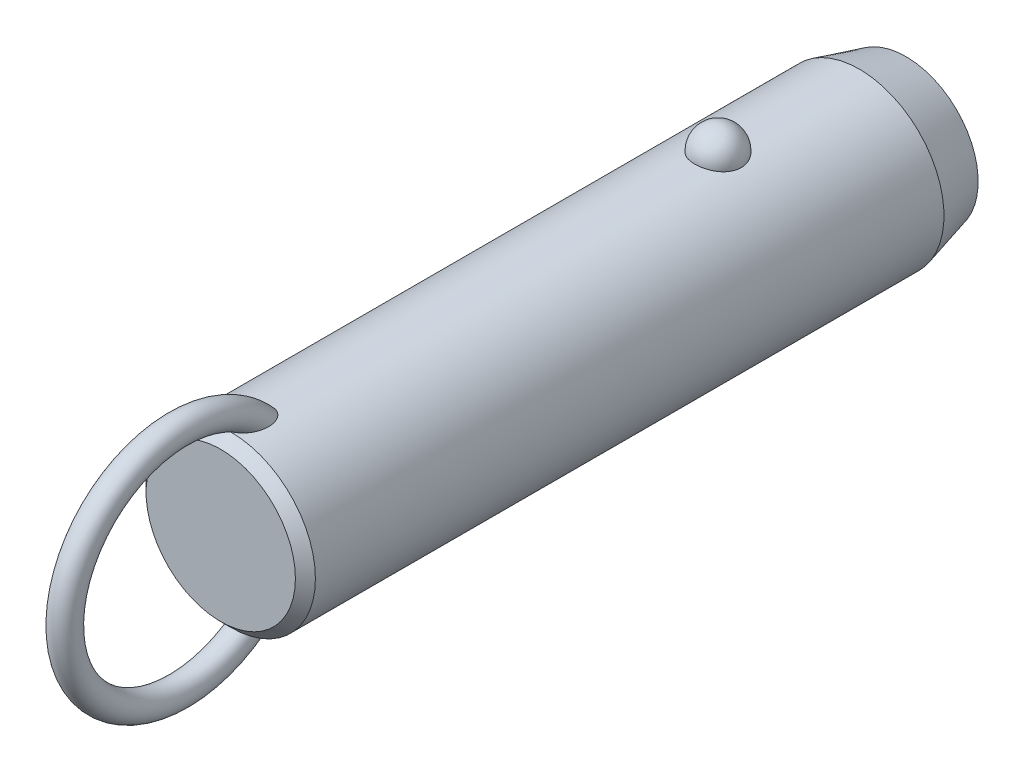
ISO-10303-21;
HEADER;
FILE_DESCRIPTION(('STEP AP214'),'2;1');
FILE_NAME('part.step','',(''),(''),'','','');
FILE_SCHEMA(('AUTOMOTIVE_DESIGN { 1 0 10303 214 1 1 1 1 }'));
ENDSEC;
DATA;
#1=APPLICATION_CONTEXT('core data for automotive mechanical design processes');
#2=APPLICATION_PROTOCOL_DEFINITION('international standard','automotive_design',2000,#1);
#3=PRODUCT_CONTEXT('',#1,'mechanical');
#4=PRODUCT('Part','Part','',(#3));
#5=PRODUCT_RELATED_PRODUCT_CATEGORY('part','',(#4));
#6=PRODUCT_DEFINITION_FORMATION('','',#4);
#7=PRODUCT_DEFINITION_CONTEXT('part definition',#1,'design');
#8=PRODUCT_DEFINITION('design','',#6,#7);
#9=PRODUCT_DEFINITION_SHAPE('','',#8);
#10=(LENGTH_UNIT() NAMED_UNIT(*) SI_UNIT(.MILLI.,.METRE.));
#11=(NAMED_UNIT(*) PLANE_ANGLE_UNIT() SI_UNIT($,.RADIAN.));
#12=(NAMED_UNIT(*) SI_UNIT($,.STERADIAN.) SOLID_ANGLE_UNIT());
#13=UNCERTAINTY_MEASURE_WITH_UNIT(LENGTH_MEASURE(1.E-05),#10,'distance_accuracy_value','');
#14=(GEOMETRIC_REPRESENTATION_CONTEXT(3) GLOBAL_UNCERTAINTY_ASSIGNED_CONTEXT((#13)) GLOBAL_UNIT_ASSIGNED_CONTEXT((#10,
#11,#12)) REPRESENTATION_CONTEXT('',''));
#15=CARTESIAN_POINT('',(0.,0.,0.));
#16=DIRECTION('',(0.,0.,1.));
#17=DIRECTION('',(1.,0.,0.));
#18=AXIS2_PLACEMENT_3D('',#15,#16,#17);
#19=CARTESIAN_POINT('',(0.,0.,58.4));
#20=DIRECTION('',(0.,0.,-1.));
#21=DIRECTION('',(-1.,0.,0.));
#22=AXIS2_PLACEMENT_3D('',#19,#20,#21);
#23=CYLINDRICAL_SURFACE('',#22,12.7);
#24=CARTESIAN_POINT('',(3.46661256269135,12.2177165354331,-3.5));
#25=CARTESIAN_POINT('',(3.4666090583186,12.2177194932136,-3.30432790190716));
#26=CARTESIAN_POINT('',(3.45063567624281,12.2222841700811,-3.10861112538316));
#27=CARTESIAN_POINT('',(3.38712451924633,12.2400345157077,-2.72271899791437));
#28=CARTESIAN_POINT('',(3.33957415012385,12.2532236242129,-2.53254588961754));
#29=CARTESIAN_POINT('',(3.2141234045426,12.286724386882,-2.16324948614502));
#30=CARTESIAN_POINT('',(3.13623639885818,12.3070329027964,-1.98412136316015));
#31=CARTESIAN_POINT('',(2.95205930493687,12.3525018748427,-1.64180592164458));
#32=CARTESIAN_POINT('',(2.84577003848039,12.3776621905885,-1.47861814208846));
#33=CARTESIAN_POINT('',(2.60688050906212,12.4301712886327,-1.17190583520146));
#34=CARTESIAN_POINT('',(2.47415697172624,12.4575299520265,-1.02847897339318));
#35=CARTESIAN_POINT('',(2.18615174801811,12.5112810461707,-0.766177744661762));
#36=CARTESIAN_POINT('',(2.03087002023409,12.5376734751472,-0.64730342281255));
#37=CARTESIAN_POINT('',(1.70237334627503,12.5864761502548,-0.437732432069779));
#38=CARTESIAN_POINT('',(1.52920948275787,12.6088972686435,-0.346958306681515));
#39=CARTESIAN_POINT('',(1.16944170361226,12.6473352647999,-0.195750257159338));
#40=CARTESIAN_POINT('',(0.982839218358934,12.663352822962,-0.135313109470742));
#41=CARTESIAN_POINT('',(0.604961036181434,12.6869706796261,-0.0473241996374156));
#42=CARTESIAN_POINT('',(0.41382314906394,12.6947125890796,-0.0192185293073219));
#43=CARTESIAN_POINT('',(0.0293827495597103,12.7014203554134,0.0051725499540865));
#44=CARTESIAN_POINT('',(-0.163919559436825,12.7003870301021,0.00146092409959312));
#45=CARTESIAN_POINT('',(-0.544374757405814,12.689735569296,-0.0373939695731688));
#46=CARTESIAN_POINT('',(-0.731575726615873,12.6802364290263,-0.0721015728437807));
#47=CARTESIAN_POINT('',(-1.09733277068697,12.6538333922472,-0.171364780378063));
#48=CARTESIAN_POINT('',(-1.27588869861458,12.6369293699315,-0.235920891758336));
#49=CARTESIAN_POINT('',(-1.6204698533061,12.5973946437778,-0.393548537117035));
#50=CARTESIAN_POINT('',(-1.78641865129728,12.5747321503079,-0.486778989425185));
#51=CARTESIAN_POINT('',(-2.10030671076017,12.5261316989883,-0.699110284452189));
#52=CARTESIAN_POINT('',(-2.24824419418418,12.5001934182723,-0.818213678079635));
#53=CARTESIAN_POINT('',(-2.52491489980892,12.4472906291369,-1.08157124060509));
#54=CARTESIAN_POINT('',(-2.65324222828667,12.4203160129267,-1.22624992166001));
#55=CARTESIAN_POINT('',(-2.88410007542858,12.3687509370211,-1.53528325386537));
#56=CARTESIAN_POINT('',(-2.98662883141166,12.3441606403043,-1.69963924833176));
#57=CARTESIAN_POINT('',(-3.16432417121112,12.2998199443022,-2.04548497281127));
#58=CARTESIAN_POINT('',(-3.23917525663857,12.2801261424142,-2.22714424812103));
#59=CARTESIAN_POINT('',(-3.35800573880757,12.248167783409,-2.6009138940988));
#60=CARTESIAN_POINT('',(-3.4019860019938,12.2359030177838,-2.79302397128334));
#61=CARTESIAN_POINT('',(-3.45784812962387,12.2202347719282,-3.18140279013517));
#62=CARTESIAN_POINT('',(-3.46986123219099,12.2167950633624,-3.37765118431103));
#63=CARTESIAN_POINT('',(-3.46186273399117,12.2190638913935,-3.76943689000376));
#64=CARTESIAN_POINT('',(-3.44185196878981,12.2247721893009,-3.96497421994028));
#65=CARTESIAN_POINT('',(-3.37048652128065,12.2446381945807,-4.34881728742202));
#66=CARTESIAN_POINT('',(-3.31928253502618,12.2587552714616,-4.53715319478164));
#67=CARTESIAN_POINT('',(-3.18693461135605,12.2938237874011,-4.90231727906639));
#68=CARTESIAN_POINT('',(-3.1057895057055,12.3147754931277,-5.07914500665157));
#69=CARTESIAN_POINT('',(-2.91506431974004,12.3613125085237,-5.41732059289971));
#70=CARTESIAN_POINT('',(-2.80533587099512,12.3869217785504,-5.57858147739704));
#71=CARTESIAN_POINT('',(-2.560414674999,12.4398525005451,-5.88013283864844));
#72=CARTESIAN_POINT('',(-2.42522099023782,12.4671740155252,-6.02042254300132));
#73=CARTESIAN_POINT('',(-2.1323357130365,12.5205965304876,-6.27662798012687));
#74=CARTESIAN_POINT('',(-1.97456596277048,12.5466928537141,-6.3924554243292));
#75=CARTESIAN_POINT('',(-1.64115839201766,12.5946384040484,-6.59583547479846));
#76=CARTESIAN_POINT('',(-1.46552179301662,12.6164879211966,-6.68339001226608));
#77=CARTESIAN_POINT('',(-1.10356050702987,12.6532533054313,-6.82682153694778));
#78=CARTESIAN_POINT('',(-0.9173913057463,12.6682500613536,-6.8830698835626));
#79=CARTESIAN_POINT('',(-0.537836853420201,12.6900288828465,-6.96386887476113));
#80=CARTESIAN_POINT('',(-0.344452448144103,12.6968119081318,-6.9884232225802));
#81=CARTESIAN_POINT('',(0.0402577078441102,12.7013667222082,-7.00496469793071));
#82=CARTESIAN_POINT('',(0.231556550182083,12.6993008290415,-6.99753844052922));
#83=CARTESIAN_POINT('',(0.610105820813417,12.6867505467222,-6.9516636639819));
#84=CARTESIAN_POINT('',(0.797356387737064,12.6762664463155,-6.913216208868));
#85=CARTESIAN_POINT('',(1.16186657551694,12.6480587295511,-6.80658431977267));
#86=CARTESIAN_POINT('',(1.33915951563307,12.6303611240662,-6.73850666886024));
#87=CARTESIAN_POINT('',(1.67968518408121,12.5896027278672,-6.5745087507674));
#88=CARTESIAN_POINT('',(1.84291705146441,12.5665416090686,-6.47858678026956));
#89=CARTESIAN_POINT('',(2.15340192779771,12.5171072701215,-6.25982455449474));
#90=CARTESIAN_POINT('',(2.30037831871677,12.4906895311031,-6.13660186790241));
#91=CARTESIAN_POINT('',(2.5717412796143,12.4376567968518,-5.86739587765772));
#92=CARTESIAN_POINT('',(2.69612388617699,12.4110417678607,-5.72140858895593));
#93=CARTESIAN_POINT('',(2.92107785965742,12.360051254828,-5.40794137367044));
#94=CARTESIAN_POINT('',(3.02121329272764,12.3357209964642,-5.24014110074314));
#95=CARTESIAN_POINT('',(3.19236291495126,12.2925446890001,-4.88969865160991));
#96=CARTESIAN_POINT('',(3.26338839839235,12.2736965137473,-4.70706226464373));
#97=CARTESIAN_POINT('',(3.36788038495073,12.245404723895,-4.35469510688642));
#98=CARTESIAN_POINT('',(3.40484026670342,12.2351018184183,-4.18605935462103));
#99=CARTESIAN_POINT('',(3.45420764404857,12.2212564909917,-3.84496058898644));
#100=CARTESIAN_POINT('',(3.46661565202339,12.2177139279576,-3.67249765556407));
#101=CARTESIAN_POINT('',(3.46661256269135,12.2177165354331,-3.5));
#102=B_SPLINE_CURVE_WITH_KNOTS('',3,(#24,#25,#26,#27,#28,#29,#30,#31,#32,#33,#34,#35,#36,#37,
#38,#39,#40,#41,#42,#43,#44,#45,#46,#47,#48,#49,#50,#51,#52,#53,#54,#55,#56,#57,#58,#59,#60,#61,
#62,#63,#64,#65,#66,#67,#68,#69,#70,#71,#72,#73,#74,#75,#76,#77,#78,#79,#80,#81,#82,#83,#84,#85,
#86,#87,#88,#89,#90,#91,#92,#93,#94,#95,#96,#97,#98,#99,#100,#101),.UNSPECIFIED.,.T.,.F.,(4,2,2,
2,2,2,2,2,2,2,2,2,2,2,2,2,2,2,2,2,2,2,2,2,2,2,2,2,2,2,2,2,2,2,2,2,2,2,4),(0.,0.586396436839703,
1.17302689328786,1.7593990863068,2.34575431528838,2.93491084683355,3.52406845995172,
4.11158733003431,4.69904375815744,5.2762784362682,5.85345931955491,6.42265312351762,
6.99185659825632,7.56427334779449,8.136746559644,8.71981013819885,9.3029135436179,
9.89247258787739,10.4820150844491,11.0691335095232,11.6562366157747,12.2405256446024,
12.8248374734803,13.412244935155,13.9996740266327,14.5891883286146,15.1786623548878,
15.7609861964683,16.3432419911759,16.9148635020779,17.4864654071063,18.0560241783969,
18.6256177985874,19.2037609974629,19.7820055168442,20.3699810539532,20.957728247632,
21.4746855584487,21.9916320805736),.UNSPECIFIED.);
#103=CARTESIAN_POINT('',(3.46661256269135,12.2177165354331,-3.5));
#104=VERTEX_POINT('',#103);
#105=EDGE_CURVE('E41',#104,#104,#102,.T.);
#106=ORIENTED_EDGE('',*,*,#105,.T.);
#107=EDGE_LOOP('',(#106));
#108=FACE_BOUND('',#107,.T.);
#109=CARTESIAN_POINT('',(0.,0.,69.6));
#110=DIRECTION('',(0.,0.,1.));
#111=DIRECTION('',(1.,0.,0.));
#112=AXIS2_PLACEMENT_3D('',#109,#110,#111);
#113=CIRCLE('',#112,12.7);
#114=CARTESIAN_POINT('',(12.7,0.,69.6));
#115=VERTEX_POINT('',#114);
#116=EDGE_CURVE('E10',#115,#115,#113,.F.);
#117=ORIENTED_EDGE('',*,*,#116,.T.);
#118=EDGE_LOOP('',(#117));
#119=FACE_BOUND('',#118,.T.);
#120=CARTESIAN_POINT('',(-0.548122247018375,-12.6881662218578,63.3432187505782));
#121=CARTESIAN_POINT('',(-0.648865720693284,-12.6838128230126,63.377926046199));
#122=CARTESIAN_POINT('',(-0.746398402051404,-12.6783867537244,63.4220428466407));
#123=CARTESIAN_POINT('',(-0.932125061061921,-12.666091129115,63.5267647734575));
#124=CARTESIAN_POINT('',(-1.02030388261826,-12.6592192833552,63.5873961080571));
#125=CARTESIAN_POINT('',(-1.18487740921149,-12.6448747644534,63.721847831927));
#126=CARTESIAN_POINT('',(-1.26134296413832,-12.637406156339,63.7955825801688));
#127=CARTESIAN_POINT('',(-1.40231200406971,-12.6225412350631,63.9536045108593));
#128=CARTESIAN_POINT('',(-1.46681470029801,-12.6151449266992,64.0378923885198));
#129=CARTESIAN_POINT('',(-1.60714786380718,-12.5981718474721,64.2496577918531));
#130=CARTESIAN_POINT('',(-1.67725126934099,-12.588900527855,64.380962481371));
#131=CARTESIAN_POINT('',(-1.79536591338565,-12.5725964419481,64.6532471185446));
#132=CARTESIAN_POINT('',(-1.84333535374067,-12.5655679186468,64.7942447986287));
#133=CARTESIAN_POINT('',(-1.93422576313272,-12.5519624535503,65.1376455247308));
#134=CARTESIAN_POINT('',(-1.96788773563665,-12.5466298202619,65.3425578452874));
#135=CARTESIAN_POINT('',(-1.9941399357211,-12.542463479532,65.6517600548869));
#136=CARTESIAN_POINT('',(-1.99883864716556,-12.5417153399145,65.7552987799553));
#137=CARTESIAN_POINT('',(-2.00078003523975,-12.5414074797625,65.9624512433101));
#138=CARTESIAN_POINT('',(-1.99802449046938,-12.5418474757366,66.0660649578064));
#139=CARTESIAN_POINT('',(-1.98336733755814,-12.5441750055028,66.3103207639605));
#140=CARTESIAN_POINT('',(-1.96851430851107,-12.5465291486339,66.4507804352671));
#141=CARTESIAN_POINT('',(-1.92707089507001,-12.5529612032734,66.7299607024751));
#142=CARTESIAN_POINT('',(-1.90047458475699,-12.5570399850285,66.8686803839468));
#143=CARTESIAN_POINT('',(-1.83619120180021,-12.5666008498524,67.1434113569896));
#144=CARTESIAN_POINT('',(-1.79850828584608,-12.57208240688,67.2794236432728));
#145=CARTESIAN_POINT('',(-1.71223796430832,-12.5841228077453,67.5478421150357));
#146=CARTESIAN_POINT('',(-1.66365679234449,-12.5906810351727,67.6802503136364));
#147=CARTESIAN_POINT('',(-1.5780450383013,-12.6016176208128,67.8854887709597));
#148=CARTESIAN_POINT('',(-1.54477252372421,-12.6057501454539,67.9599149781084));
#149=CARTESIAN_POINT('',(-1.47424480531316,-12.6141930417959,68.1068393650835));
#150=CARTESIAN_POINT('',(-1.43699041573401,-12.6185033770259,68.1793379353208));
#151=CARTESIAN_POINT('',(-1.35825795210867,-12.6272207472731,68.3218926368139));
#152=CARTESIAN_POINT('',(-1.31678520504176,-12.6316276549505,68.3919517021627));
#153=CARTESIAN_POINT('',(-1.22917793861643,-12.6404532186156,68.5290705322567));
#154=CARTESIAN_POINT('',(-1.18304514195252,-12.6448718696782,68.5961313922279));
#155=CARTESIAN_POINT('',(-1.07246411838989,-12.6547893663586,68.7438741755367));
#156=CARTESIAN_POINT('',(-1.00642239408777,-12.6602600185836,68.8233844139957));
#157=CARTESIAN_POINT('',(-0.864441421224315,-12.6707460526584,68.9731698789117));
#158=CARTESIAN_POINT('',(-0.788516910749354,-12.6757620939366,69.0434585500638));
#159=CARTESIAN_POINT('',(-0.652215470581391,-12.6833591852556,69.1486801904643));
#160=CARTESIAN_POINT('',(-0.594982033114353,-12.6861973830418,69.1876241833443));
#161=CARTESIAN_POINT('',(-0.475269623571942,-12.6912445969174,69.2564899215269));
#162=CARTESIAN_POINT('',(-0.412800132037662,-12.6934547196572,69.2864275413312));
#163=CARTESIAN_POINT('',(-0.295749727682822,-12.6966636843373,69.3297565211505));
#164=CARTESIAN_POINT('',(-0.241949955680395,-12.6978134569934,69.3452188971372));
#165=CARTESIAN_POINT('',(-0.132508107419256,-12.6994261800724,69.3668845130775));
#166=CARTESIAN_POINT('',(-0.0768679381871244,-12.6998898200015,69.3730970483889));
#167=CARTESIAN_POINT('',(0.0347696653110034,-12.7000752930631,69.3755838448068));
#168=CARTESIAN_POINT('',(0.0907676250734,-12.6997954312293,69.3718353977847));
#169=CARTESIAN_POINT('',(0.201283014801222,-12.6985255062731,69.3547883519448));
#170=CARTESIAN_POINT('',(0.255799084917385,-12.6975348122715,69.3414812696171));
#171=CARTESIAN_POINT('',(0.376042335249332,-12.6946091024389,69.3020379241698));
#172=CARTESIAN_POINT('',(0.44095085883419,-12.6924943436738,69.2734492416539));
#173=CARTESIAN_POINT('',(0.565350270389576,-12.6875639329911,69.2063234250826));
#174=CARTESIAN_POINT('',(0.624828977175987,-12.6847467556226,69.1677646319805));
#175=CARTESIAN_POINT('',(0.774116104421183,-12.6767252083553,69.056949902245));
#176=CARTESIAN_POINT('',(0.859449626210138,-12.6711344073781,68.9787605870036));
#177=CARTESIAN_POINT('',(1.01789440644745,-12.6593922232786,68.810943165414));
#178=CARTESIAN_POINT('',(1.09096902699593,-12.653239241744,68.721282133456));
#179=CARTESIAN_POINT('',(1.22268793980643,-12.6411674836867,68.5402658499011));
#180=CARTESIAN_POINT('',(1.28193986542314,-12.6352572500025,68.449345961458));
#181=CARTESIAN_POINT('',(1.39259777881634,-12.6235401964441,68.2627929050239));
#182=CARTESIAN_POINT('',(1.44399707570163,-12.6177334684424,68.1671558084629));
#183=CARTESIAN_POINT('',(1.53972870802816,-12.6064093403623,67.9722738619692));
#184=CARTESIAN_POINT('',(1.58405262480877,-12.6008922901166,67.8730248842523));
#185=CARTESIAN_POINT('',(1.66600705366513,-12.5903187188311,67.6717727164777));
#186=CARTESIAN_POINT('',(1.70363651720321,-12.5852622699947,67.5697690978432));
#187=CARTESIAN_POINT('',(1.77545379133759,-12.5753406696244,67.3543580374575));
#188=CARTESIAN_POINT('',(1.80903453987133,-12.5705328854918,67.240745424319));
#189=CARTESIAN_POINT('',(1.86844163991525,-12.5618400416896,67.0114575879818));
#190=CARTESIAN_POINT('',(1.89426665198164,-12.5579551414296,66.8957820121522));
#191=CARTESIAN_POINT('',(1.9378546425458,-12.5513030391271,66.6630072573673));
#192=CARTESIAN_POINT('',(1.95562640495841,-12.5485346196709,66.5459097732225));
#193=CARTESIAN_POINT('',(1.98264463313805,-12.5442934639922,66.3107473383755));
#194=CARTESIAN_POINT('',(1.99189298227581,-12.5428204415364,66.1926826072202));
#195=CARTESIAN_POINT('',(2.00416068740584,-12.540871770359,65.8806225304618));
#196=CARTESIAN_POINT('',(1.99944433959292,-12.541631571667,65.6862290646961));
#197=CARTESIAN_POINT('',(1.96113755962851,-12.5476846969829,65.3003095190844));
#198=CARTESIAN_POINT('',(1.92758341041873,-12.5529723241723,65.1087801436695));
#199=CARTESIAN_POINT('',(1.8393434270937,-12.5661532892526,64.7822728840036));
#200=CARTESIAN_POINT('',(1.79215440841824,-12.5730485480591,64.6452499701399));
#201=CARTESIAN_POINT('',(1.67676242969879,-12.588958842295,64.3804459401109));
#202=CARTESIAN_POINT('',(1.60859050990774,-12.597970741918,64.2526515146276));
#203=CARTESIAN_POINT('',(1.46583832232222,-12.6152829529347,64.0358006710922));
#204=CARTESIAN_POINT('',(1.39525727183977,-12.6233659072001,63.9441050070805));
#205=CARTESIAN_POINT('',(1.23992594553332,-12.6395676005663,63.7734854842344));
#206=CARTESIAN_POINT('',(1.15517932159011,-12.6476863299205,63.6945583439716));
#207=CARTESIAN_POINT('',(0.971995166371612,-12.6630846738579,63.5526438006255));
#208=CARTESIAN_POINT('',(0.873456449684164,-12.6703572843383,63.4897849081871));
#209=CARTESIAN_POINT('',(0.665847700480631,-12.6829569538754,63.3844870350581));
#210=CARTESIAN_POINT('',(0.556784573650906,-12.688285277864,63.3420347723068));
#211=CARTESIAN_POINT('',(0.347338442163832,-12.6956226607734,63.2844434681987));
#212=CARTESIAN_POINT('',(0.24775974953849,-12.6979816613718,63.2663996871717));
#213=CARTESIAN_POINT('',(0.0470218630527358,-12.7003077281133,63.2486007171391));
#214=CARTESIAN_POINT('',(-0.0541350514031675,-12.7002779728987,63.2488212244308));
#215=CARTESIAN_POINT('',(-0.22141402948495,-12.6982482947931,63.2643639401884));
#216=CARTESIAN_POINT('',(-0.288055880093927,-12.6969033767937,63.2746662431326));
#217=CARTESIAN_POINT('',(-0.419599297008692,-12.6932369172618,63.3031348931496));
#218=CARTESIAN_POINT('',(-0.48450102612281,-12.6909154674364,63.3213005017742));
#219=CARTESIAN_POINT('',(-0.548122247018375,-12.6881662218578,63.3432187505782));
#220=B_SPLINE_CURVE_WITH_KNOTS('',3,(#120,#121,#122,#123,#124,#125,#126,#127,#128,#129,#130,
#131,#132,#133,#134,#135,#136,#137,#138,#139,#140,#141,#142,#143,#144,#145,#146,#147,#148,#149,
#150,#151,#152,#153,#154,#155,#156,#157,#158,#159,#160,#161,#162,#163,#164,#165,#166,#167,#168,
#169,#170,#171,#172,#173,#174,#175,#176,#177,#178,#179,#180,#181,#182,#183,#184,#185,#186,#187,
#188,#189,#190,#191,#192,#193,#194,#195,#196,#197,#198,#199,#200,#201,#202,#203,#204,#205,#206,
#207,#208,#209,#210,#211,#212,#213,#214,#215,#216,#217,#218,#219),.UNSPECIFIED.,.T.,.F.,(4,2,2,
2,2,2,2,2,2,2,2,2,2,2,2,2,2,2,2,2,2,2,2,2,2,2,2,2,2,2,2,2,2,2,2,2,2,2,2,2,2,2,2,2,2,2,2,2,2,4),
(0.,0.319642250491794,0.639794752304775,0.957927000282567,1.27608021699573,1.72100165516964,
2.16675988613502,2.78630021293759,3.09705782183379,3.40774128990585,3.83096358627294,
4.25439969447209,4.67767724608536,5.10071330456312,5.34550297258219,5.59024267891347,
5.83467707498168,6.07902143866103,6.38891080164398,6.69834321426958,6.90560910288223,
7.11250749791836,7.27977315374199,7.44687060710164,7.61434932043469,7.78197685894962,
7.99365544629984,8.20579780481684,8.55147335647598,8.8981642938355,9.2237513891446,
9.54961437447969,9.87586224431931,10.202161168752,10.557587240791,10.9130746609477,
11.2681734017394,11.6231936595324,12.2046601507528,12.7853961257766,13.219164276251,
13.6522938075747,13.9989174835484,14.3454519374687,14.6946768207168,15.0436740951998,
15.3457513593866,15.6474266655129,15.8493051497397,16.0511646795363),.UNSPECIFIED.);
#221=CARTESIAN_POINT('',(-0.548122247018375,-12.6881662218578,63.3432187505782));
#222=VERTEX_POINT('',#221);
#223=EDGE_CURVE('E60',#222,#222,#220,.T.);
#224=ORIENTED_EDGE('',*,*,#223,.T.);
#225=EDGE_LOOP('',(#224));
#226=FACE_BOUND('',#225,.T.);
#227=CARTESIAN_POINT('',(-0.548122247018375,12.6881662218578,63.3432187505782));
#228=CARTESIAN_POINT('',(-0.459436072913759,12.6919968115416,63.312673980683));
#229=CARTESIAN_POINT('',(-0.368189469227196,12.6949996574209,63.2893913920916));
#230=CARTESIAN_POINT('',(-0.183024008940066,12.6990186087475,63.2584062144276));
#231=CARTESIAN_POINT('',(-0.0891049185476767,12.7000345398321,63.2507049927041));
#232=CARTESIAN_POINT('',(0.0987147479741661,12.6999636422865,63.2512455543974));
#233=CARTESIAN_POINT('',(0.1926153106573,12.6988761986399,63.259492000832));
#234=CARTESIAN_POINT('',(0.377658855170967,12.6947211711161,63.2915515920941));
#235=CARTESIAN_POINT('',(0.46880177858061,12.6916535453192,63.3153650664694));
#236=CARTESIAN_POINT('',(0.645809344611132,12.6838788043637,63.3774565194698));
#237=CARTESIAN_POINT('',(0.731679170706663,12.6791733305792,63.415720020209));
#238=CARTESIAN_POINT('',(0.896315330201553,12.6686004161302,63.505120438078));
#239=CARTESIAN_POINT('',(0.975080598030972,12.6627328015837,63.5562592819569));
#240=CARTESIAN_POINT('',(1.12963655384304,12.6499161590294,63.6736782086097));
#241=CARTESIAN_POINT('',(1.20478673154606,12.6429194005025,63.7407929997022));
#242=CARTESIAN_POINT('',(1.34448241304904,12.6288282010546,63.8852250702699));
#243=CARTESIAN_POINT('',(1.40902173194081,12.621733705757,63.9625482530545));
#244=CARTESIAN_POINT('',(1.55208211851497,12.6050877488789,64.1592475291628));
#245=CARTESIAN_POINT('',(1.62510490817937,12.5957546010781,64.2826540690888));
#246=CARTESIAN_POINT('',(1.7501904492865,12.5789823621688,64.5397690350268));
#247=CARTESIAN_POINT('',(1.80221377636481,12.5715468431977,64.673496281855));
#248=CARTESIAN_POINT('',(1.90309965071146,12.5567434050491,64.9983516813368));
#249=CARTESIAN_POINT('',(1.94342317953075,12.5504515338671,65.1921611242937));
#250=CARTESIAN_POINT('',(1.99332997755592,12.5426147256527,65.5837881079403));
#251=CARTESIAN_POINT('',(2.00285305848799,12.5410790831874,65.7816127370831));
#252=CARTESIAN_POINT('',(1.99678999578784,12.5420407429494,66.1166427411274));
#253=CARTESIAN_POINT('',(1.98794117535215,12.5434564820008,66.2540428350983));
#254=CARTESIAN_POINT('',(1.95865119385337,12.5480641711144,66.5276394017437));
#255=CARTESIAN_POINT('',(1.93820436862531,12.5512569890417,66.6638352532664));
#256=CARTESIAN_POINT('',(1.88647896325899,12.5591352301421,66.9342493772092));
#257=CARTESIAN_POINT('',(1.85518800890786,12.5638223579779,67.0684652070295));
#258=CARTESIAN_POINT('',(1.78217886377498,12.5743868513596,67.3339362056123));
#259=CARTESIAN_POINT('',(1.74046509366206,12.5802637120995,67.4651926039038));
#260=CARTESIAN_POINT('',(1.66024095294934,12.5910571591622,67.6860855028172));
#261=CARTESIAN_POINT('',(1.62434772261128,12.5957535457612,67.7766904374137));
#262=CARTESIAN_POINT('',(1.54709009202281,12.6054762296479,67.9555125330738));
#263=CARTESIAN_POINT('',(1.50572681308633,12.6105024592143,68.0437301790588));
#264=CARTESIAN_POINT('',(1.41728020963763,12.620748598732,68.2169321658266));
#265=CARTESIAN_POINT('',(1.37021377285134,12.625967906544,68.3019251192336));
#266=CARTESIAN_POINT('',(1.26969620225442,12.6364721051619,68.4680072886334));
#267=CARTESIAN_POINT('',(1.21624929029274,12.6417569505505,68.5490990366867));
#268=CARTESIAN_POINT('',(1.10304413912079,12.6521331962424,68.7047027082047));
#269=CARTESIAN_POINT('',(1.04340936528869,12.657226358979,68.7793033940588));
#270=CARTESIAN_POINT('',(0.915919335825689,12.6670906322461,68.921324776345));
#271=CARTESIAN_POINT('',(0.848064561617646,12.6718617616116,68.9887458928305));
#272=CARTESIAN_POINT('',(0.71703570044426,12.67987711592,69.1006247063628));
#273=CARTESIAN_POINT('',(0.655526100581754,12.6832377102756,69.1469970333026));
#274=CARTESIAN_POINT('',(0.525985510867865,12.6892676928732,69.2296195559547));
#275=CARTESIAN_POINT('',(0.457969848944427,12.6919386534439,69.2658927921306));
#276=CARTESIAN_POINT('',(0.334859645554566,12.695691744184,69.3166572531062));
#277=CARTESIAN_POINT('',(0.281116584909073,12.6970073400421,69.3343733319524));
#278=CARTESIAN_POINT('',(0.171425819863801,12.6989609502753,69.3606429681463));
#279=CARTESIAN_POINT('',(0.115480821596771,12.699599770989,69.3692074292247));
#280=CARTESIAN_POINT('',(0.0027261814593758,12.7001251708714,69.3762531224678));
#281=CARTESIAN_POINT('',(-0.0540859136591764,12.7000089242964,69.3746964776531));
#282=CARTESIAN_POINT('',(-0.166544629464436,12.6990328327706,69.3616005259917));
#283=CARTESIAN_POINT('',(-0.22219029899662,12.6981724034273,69.3500533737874));
#284=CARTESIAN_POINT('',(-0.342018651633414,12.695562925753,69.3149128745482));
#285=CARTESIAN_POINT('',(-0.405606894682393,12.6936676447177,69.2893322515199));
#286=CARTESIAN_POINT('',(-0.527815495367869,12.6891754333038,69.2283111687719));
#287=CARTESIAN_POINT('',(-0.586425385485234,12.6865770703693,69.1928505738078));
#288=CARTESIAN_POINT('',(-0.731842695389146,12.6792129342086,69.0914960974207));
#289=CARTESIAN_POINT('',(-0.814709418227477,12.6740767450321,69.0200395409));
#290=CARTESIAN_POINT('',(-0.969101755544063,12.6632083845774,68.8658900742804));
#291=CARTESIAN_POINT('',(-1.04059564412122,12.6574746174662,68.7831668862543));
#292=CARTESIAN_POINT('',(-1.16981116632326,12.6461638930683,68.6158096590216));
#293=CARTESIAN_POINT('',(-1.22811369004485,12.6405994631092,68.5316166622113));
#294=CARTESIAN_POINT('',(-1.33743405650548,12.6295007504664,68.3585791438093));
#295=CARTESIAN_POINT('',(-1.38844577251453,12.6239664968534,68.2697307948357));
#296=CARTESIAN_POINT('',(-1.48400702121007,12.6130898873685,68.088389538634));
#297=CARTESIAN_POINT('',(-1.52854232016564,12.6077479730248,67.9958891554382));
#298=CARTESIAN_POINT('',(-1.61150113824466,12.5974127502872,67.8081607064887));
#299=CARTESIAN_POINT('',(-1.64992317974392,12.5924195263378,67.712931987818));
#300=CARTESIAN_POINT('',(-1.73468589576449,12.581070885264,67.4828936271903));
#301=CARTESIAN_POINT('',(-1.77831261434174,12.5749388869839,67.3470661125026));
#302=CARTESIAN_POINT('',(-1.85439734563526,12.5639437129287,67.0722128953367));
#303=CARTESIAN_POINT('',(-1.88684994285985,12.5590811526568,66.9331856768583));
#304=CARTESIAN_POINT('',(-1.94008483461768,12.550968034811,66.6530923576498));
#305=CARTESIAN_POINT('',(-1.96088706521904,12.5477147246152,66.5120301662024));
#306=CARTESIAN_POINT('',(-1.99000539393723,12.5431291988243,66.2286689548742));
#307=CARTESIAN_POINT('',(-1.99832911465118,12.5417958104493,66.0863707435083));
#308=CARTESIAN_POINT('',(-2.00166624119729,12.5412674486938,65.7576271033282));
#309=CARTESIAN_POINT('',(-1.99178843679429,12.5428579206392,65.5710880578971));
#310=CARTESIAN_POINT('',(-1.94455183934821,12.5502731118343,65.2016240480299));
#311=CARTESIAN_POINT('',(-1.9072403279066,12.5560905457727,65.0186934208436));
#312=CARTESIAN_POINT('',(-1.81330718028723,12.5699462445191,64.7048488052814));
#313=CARTESIAN_POINT('',(-1.7633882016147,12.5771273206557,64.5719105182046));
#314=CARTESIAN_POINT('',(-1.64305018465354,12.593414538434,64.3156813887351));
#315=CARTESIAN_POINT('',(-1.57265346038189,12.6025185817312,64.192380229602));
#316=CARTESIAN_POINT('',(-1.42634956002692,12.6198178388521,63.9835648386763));
#317=CARTESIAN_POINT('',(-1.35423772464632,12.6278405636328,63.8953846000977));
#318=CARTESIAN_POINT('',(-1.19645664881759,12.6437632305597,63.732107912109));
#319=CARTESIAN_POINT('',(-1.11080536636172,12.6516633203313,63.6569944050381));
#320=CARTESIAN_POINT('',(-0.947219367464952,12.6648319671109,63.537811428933));
#321=CARTESIAN_POINT('',(-0.871624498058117,12.670300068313,63.4905414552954));
#322=CARTESIAN_POINT('',(-0.714161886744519,12.6801492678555,63.4077413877));
#323=CARTESIAN_POINT('',(-0.632295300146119,12.684530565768,63.3722091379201));
#324=CARTESIAN_POINT('',(-0.548122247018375,12.6881662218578,63.3432187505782));
#325=B_SPLINE_CURVE_WITH_KNOTS('',3,(#227,#228,#229,#230,#231,#232,#233,#234,#235,#236,#237,
#238,#239,#240,#241,#242,#243,#244,#245,#246,#247,#248,#249,#250,#251,#252,#253,#254,#255,#256,
#257,#258,#259,#260,#261,#262,#263,#264,#265,#266,#267,#268,#269,#270,#271,#272,#273,#274,#275,
#276,#277,#278,#279,#280,#281,#282,#283,#284,#285,#286,#287,#288,#289,#290,#291,#292,#293,#294,
#295,#296,#297,#298,#299,#300,#301,#302,#303,#304,#305,#306,#307,#308,#309,#310,#311,#312,#313,
#314,#315,#316,#317,#318,#319,#320,#321,#322,#323,#324),.UNSPECIFIED.,.T.,.F.,(4,2,2,2,2,2,2,2,
2,2,2,2,2,2,2,2,2,2,2,2,2,2,2,2,2,2,2,2,2,2,2,2,2,2,2,2,2,2,2,2,2,2,2,2,2,2,2,2,4),(0.,
0.281328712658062,0.56268211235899,0.844117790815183,1.12555942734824,1.40671982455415,
1.68792232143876,1.98972294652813,2.29169886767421,2.72039860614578,3.14989948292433,
3.74084916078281,4.33295293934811,4.74554109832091,5.15833092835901,5.57159335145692,
5.98468079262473,6.27722775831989,6.56971484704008,6.86135609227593,7.15280542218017,
7.4392740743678,7.72572595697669,7.95635862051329,8.18646071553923,8.35559393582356,
8.52452541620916,8.69408946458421,8.86378678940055,9.0683434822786,9.27332014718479,
9.60010414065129,9.92778432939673,10.2350252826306,10.5425229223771,10.8506864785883,
11.15892440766,11.5867893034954,12.0148612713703,12.4421984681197,12.8692745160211,
13.4279365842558,13.9856380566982,14.4107062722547,14.835313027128,15.1765567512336,
15.517351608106,15.7844129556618,16.051425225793),.UNSPECIFIED.);
#326=CARTESIAN_POINT('',(-0.548122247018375,12.6881662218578,63.3432187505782));
#327=VERTEX_POINT('',#326);
#328=EDGE_CURVE('E68',#327,#327,#325,.T.);
#329=ORIENTED_EDGE('',*,*,#328,.T.);
#330=EDGE_LOOP('',(#329));
#331=FACE_BOUND('',#330,.T.);
#332=CARTESIAN_POINT('',(0.,0.,-24.6999999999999));
#333=DIRECTION('',(0.,0.,-1.));
#334=DIRECTION('',(-1.,0.,0.));
#335=AXIS2_PLACEMENT_3D('',#332,#333,#334);
#336=CIRCLE('',#335,12.7);
#337=CARTESIAN_POINT('',(-12.7,0.,-24.6999999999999));
#338=VERTEX_POINT('',#337);
#339=EDGE_CURVE('E57',#338,#338,#336,.F.);
#340=ORIENTED_EDGE('',*,*,#339,.T.);
#341=EDGE_LOOP('',(#340));
#342=FACE_BOUND('',#341,.T.);
#343=ADVANCED_FACE('F37',(#108,#119,#226,#331,#342),#23,.T.);
#344=CARTESIAN_POINT('',(0.,0.,-31.7));
#345=DIRECTION('',(0.,0.,-1.));
#346=DIRECTION('',(-1.,0.,0.));
#347=AXIS2_PLACEMENT_3D('',#344,#345,#346);
#348=PLANE('',#347);
#349=CARTESIAN_POINT('',(0.,0.,-31.7));
#350=DIRECTION('',(0.,0.,-1.));
#351=DIRECTION('',(-1.,0.,0.));
#352=AXIS2_PLACEMENT_3D('',#349,#350,#351);
#353=CIRCLE('',#352,10.8243556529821);
#354=CARTESIAN_POINT('',(-10.8243556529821,0.,-31.7));
#355=VERTEX_POINT('',#354);
#356=EDGE_CURVE('E67',#355,#355,#353,.T.);
#357=ORIENTED_EDGE('',*,*,#356,.T.);
#358=EDGE_LOOP('',(#357));
#359=FACE_BOUND('',#358,.T.);
#360=ADVANCED_FACE('F86',(#359),#348,.T.);
#361=CARTESIAN_POINT('',(0.,0.,-31.7));
#362=DIRECTION('',(0.,0.,1.));
#363=DIRECTION('',(1.,0.,0.));
#364=AXIS2_PLACEMENT_3D('',#361,#362,#363);
#365=CONICAL_SURFACE('',#364,10.8243556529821,0.261799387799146);
#366=ORIENTED_EDGE('',*,*,#339,.F.);
#367=EDGE_LOOP('',(#366));
#368=FACE_BOUND('',#367,.T.);
#369=ORIENTED_EDGE('',*,*,#356,.F.);
#370=EDGE_LOOP('',(#369));
#371=FACE_BOUND('',#370,.T.);
#372=ADVANCED_FACE('F84',(#368,#371),#365,.T.);
#373=CARTESIAN_POINT('',(0.,0.,71.1));
#374=DIRECTION('',(0.,0.,1.));
#375=DIRECTION('',(1.,0.,0.));
#376=AXIS2_PLACEMENT_3D('',#373,#374,#375);
#377=PLANE('',#376);
#378=CARTESIAN_POINT('',(0.,0.,71.1));
#379=DIRECTION('',(0.,0.,1.));
#380=DIRECTION('',(1.,0.,0.));
#381=AXIS2_PLACEMENT_3D('',#378,#379,#380);
#382=CIRCLE('',#381,11.2);
#383=CARTESIAN_POINT('',(11.2,0.,71.1));
#384=VERTEX_POINT('',#383);
#385=EDGE_CURVE('E50',#384,#384,#382,.T.);
#386=ORIENTED_EDGE('',*,*,#385,.T.);
#387=EDGE_LOOP('',(#386));
#388=FACE_BOUND('',#387,.T.);
#389=ADVANCED_FACE('F78',(#388),#377,.T.);
#390=CARTESIAN_POINT('',(0.,0.,77.45));
#391=DIRECTION('',(1.,0.,0.));
#392=DIRECTION('',(0.,0.,-1.));
#393=AXIS2_PLACEMENT_3D('',#390,#391,#392);
#394=TOROIDAL_SURFACE('',#393,17.05,2.);
#395=ORIENTED_EDGE('',*,*,#328,.F.);
#396=EDGE_LOOP('',(#395));
#397=FACE_BOUND('',#396,.T.);
#398=ORIENTED_EDGE('',*,*,#223,.F.);
#399=EDGE_LOOP('',(#398));
#400=FACE_BOUND('',#399,.T.);
#401=ADVANCED_FACE('F74',(#397,#400),#394,.T.);
#402=CARTESIAN_POINT('',(0.,0.,71.1));
#403=DIRECTION('',(0.,0.,-1.));
#404=DIRECTION('',(-1.,0.,0.));
#405=AXIS2_PLACEMENT_3D('',#402,#403,#404);
#406=CONICAL_SURFACE('',#405,11.2,0.785398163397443);
#407=ORIENTED_EDGE('',*,*,#116,.F.);
#408=EDGE_LOOP('',(#407));
#409=FACE_BOUND('',#408,.T.);
#410=ORIENTED_EDGE('',*,*,#385,.F.);
#411=EDGE_LOOP('',(#410));
#412=FACE_BOUND('',#411,.T.);
#413=ADVANCED_FACE('F39',(#409,#412),#406,.T.);
#414=CARTESIAN_POINT('',(0.,12.7,-3.5));
#415=DIRECTION('',(0.,1.,0.));
#416=DIRECTION('',(0.,0.,-1.));
#417=AXIS2_PLACEMENT_3D('',#414,#415,#416);
#418=SPHERICAL_SURFACE('',#417,3.5);
#419=ORIENTED_EDGE('',*,*,#105,.F.);
#420=EDGE_LOOP('',(#419));
#421=FACE_BOUND('',#420,.T.);
#422=ADVANCED_FACE('F80',(#421),#418,.T.);
#423=CLOSED_SHELL('',(#343,#360,#372,#389,#401,#413,#422));
#424=MANIFOLD_SOLID_BREP('B2',#423);
#425=ADVANCED_BREP_SHAPE_REPRESENTATION('',(#18,#424),#14);
#426=SHAPE_DEFINITION_REPRESENTATION(#9,#425);
ENDSEC;
END-ISO-10303-21;
